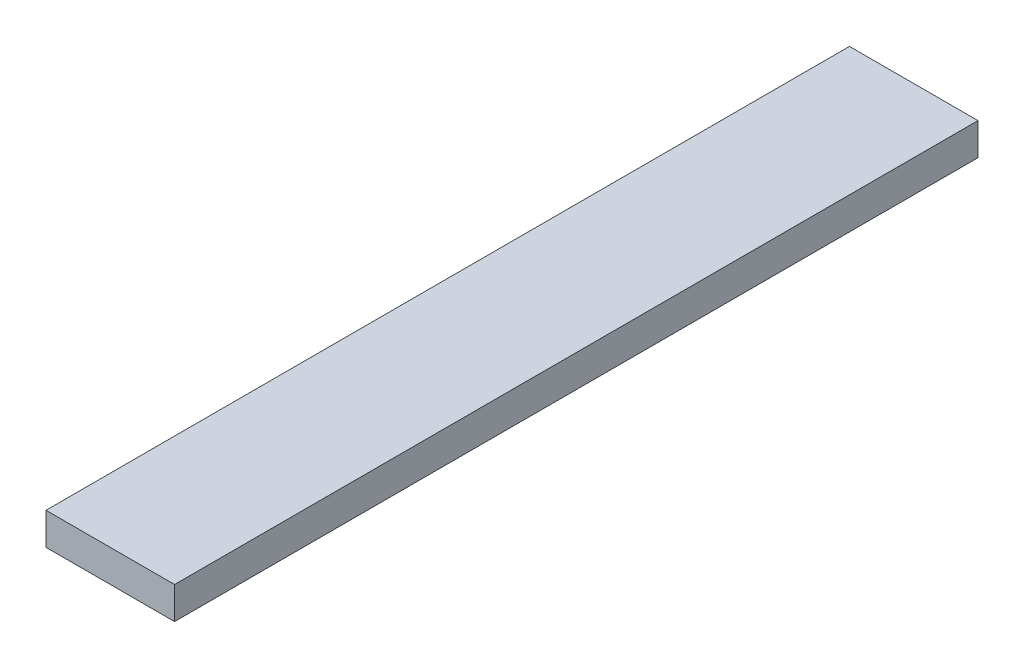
ISO-10303-21;
HEADER;
FILE_DESCRIPTION(('STEP AP214'),'2;1');
FILE_NAME('part.step','',(''),(''),'','','');
FILE_SCHEMA(('AUTOMOTIVE_DESIGN { 1 0 10303 214 1 1 1 1 }'));
ENDSEC;
DATA;
#1=APPLICATION_CONTEXT('core data for automotive mechanical design processes');
#2=APPLICATION_PROTOCOL_DEFINITION('international standard','automotive_design',2000,#1);
#3=PRODUCT_CONTEXT('',#1,'mechanical');
#4=PRODUCT('Part','Part','',(#3));
#5=PRODUCT_RELATED_PRODUCT_CATEGORY('part','',(#4));
#6=PRODUCT_DEFINITION_FORMATION('','',#4);
#7=PRODUCT_DEFINITION_CONTEXT('part definition',#1,'design');
#8=PRODUCT_DEFINITION('design','',#6,#7);
#9=PRODUCT_DEFINITION_SHAPE('','',#8);
#10=(LENGTH_UNIT() NAMED_UNIT(*) SI_UNIT(.MILLI.,.METRE.));
#11=(NAMED_UNIT(*) PLANE_ANGLE_UNIT() SI_UNIT($,.RADIAN.));
#12=(NAMED_UNIT(*) SI_UNIT($,.STERADIAN.) SOLID_ANGLE_UNIT());
#13=UNCERTAINTY_MEASURE_WITH_UNIT(LENGTH_MEASURE(1.E-05),#10,'distance_accuracy_value','');
#14=(GEOMETRIC_REPRESENTATION_CONTEXT(3) GLOBAL_UNCERTAINTY_ASSIGNED_CONTEXT((#13)) GLOBAL_UNIT_ASSIGNED_CONTEXT((#10,
#11,#12)) REPRESENTATION_CONTEXT('',''));
#15=CARTESIAN_POINT('',(0.,0.,0.));
#16=DIRECTION('',(0.,0.,1.));
#17=DIRECTION('',(1.,0.,0.));
#18=AXIS2_PLACEMENT_3D('',#15,#16,#17);
#19=CARTESIAN_POINT('',(0.,0.,50.));
#20=DIRECTION('',(1.,0.,0.));
#21=DIRECTION('',(0.,0.,-1.));
#22=AXIS2_PLACEMENT_3D('',#19,#20,#21);
#23=PLANE('',#22);
#24=DIRECTION('',(0.,-1.,0.));
#25=VECTOR('',#24,1.);
#26=CARTESIAN_POINT('',(0.,0.,0.));
#27=LINE('',#26,#25);
#28=CARTESIAN_POINT('',(0.,2.,0.));
#29=VERTEX_POINT('',#28);
#30=CARTESIAN_POINT('',(0.,0.,0.));
#31=VERTEX_POINT('',#30);
#32=EDGE_CURVE('E70',#29,#31,#27,.T.);
#33=ORIENTED_EDGE('',*,*,#32,.T.);
#34=DIRECTION('',(0.,0.,-1.));
#35=VECTOR('',#34,1.);
#36=CARTESIAN_POINT('',(0.,0.,50.));
#37=LINE('',#36,#35);
#38=CARTESIAN_POINT('',(0.,0.,50.));
#39=VERTEX_POINT('',#38);
#40=EDGE_CURVE('E11',#39,#31,#37,.T.);
#41=ORIENTED_EDGE('',*,*,#40,.F.);
#42=DIRECTION('',(0.,-1.,0.));
#43=VECTOR('',#42,1.);
#44=CARTESIAN_POINT('',(0.,0.,50.));
#45=LINE('',#44,#43);
#46=CARTESIAN_POINT('',(0.,2.,50.));
#47=VERTEX_POINT('',#46);
#48=EDGE_CURVE('E88',#47,#39,#45,.T.);
#49=ORIENTED_EDGE('',*,*,#48,.F.);
#50=DIRECTION('',(0.,0.,-1.));
#51=VECTOR('',#50,1.);
#52=CARTESIAN_POINT('',(0.,2.,50.));
#53=LINE('',#52,#51);
#54=EDGE_CURVE('E82',#47,#29,#53,.T.);
#55=ORIENTED_EDGE('',*,*,#54,.T.);
#56=EDGE_LOOP('',(#33,#41,#49,#55));
#57=FACE_BOUND('',#56,.T.);
#58=ADVANCED_FACE('F26',(#57),#23,.F.);
#59=CARTESIAN_POINT('',(0.,0.,50.));
#60=DIRECTION('',(0.,1.,0.));
#61=DIRECTION('',(0.,0.,1.));
#62=AXIS2_PLACEMENT_3D('',#59,#60,#61);
#63=PLANE('',#62);
#64=DIRECTION('',(1.,0.,0.));
#65=VECTOR('',#64,1.);
#66=CARTESIAN_POINT('',(0.,0.,0.));
#67=LINE('',#66,#65);
#68=CARTESIAN_POINT('',(8.,0.,0.));
#69=VERTEX_POINT('',#68);
#70=EDGE_CURVE('E66',#31,#69,#67,.T.);
#71=ORIENTED_EDGE('',*,*,#70,.T.);
#72=DIRECTION('',(0.,0.,-1.));
#73=VECTOR('',#72,1.);
#74=CARTESIAN_POINT('',(8.,0.,50.));
#75=LINE('',#74,#73);
#76=CARTESIAN_POINT('',(8.,0.,50.));
#77=VERTEX_POINT('',#76);
#78=EDGE_CURVE('E33',#77,#69,#75,.T.);
#79=ORIENTED_EDGE('',*,*,#78,.F.);
#80=DIRECTION('',(1.,0.,0.));
#81=VECTOR('',#80,1.);
#82=CARTESIAN_POINT('',(0.,0.,50.));
#83=LINE('',#82,#81);
#84=EDGE_CURVE('E78',#39,#77,#83,.T.);
#85=ORIENTED_EDGE('',*,*,#84,.F.);
#86=ORIENTED_EDGE('',*,*,#40,.T.);
#87=EDGE_LOOP('',(#71,#79,#85,#86));
#88=FACE_BOUND('',#87,.T.);
#89=ADVANCED_FACE('F77',(#88),#63,.F.);
#90=CARTESIAN_POINT('',(8.,0.,50.));
#91=DIRECTION('',(-1.,0.,0.));
#92=DIRECTION('',(0.,0.,1.));
#93=AXIS2_PLACEMENT_3D('',#90,#91,#92);
#94=PLANE('',#93);
#95=DIRECTION('',(0.,1.,0.));
#96=VECTOR('',#95,1.);
#97=CARTESIAN_POINT('',(8.,0.,0.));
#98=LINE('',#97,#96);
#99=CARTESIAN_POINT('',(8.,2.,0.));
#100=VERTEX_POINT('',#99);
#101=EDGE_CURVE('E71',#69,#100,#98,.T.);
#102=ORIENTED_EDGE('',*,*,#101,.T.);
#103=DIRECTION('',(0.,0.,-1.));
#104=VECTOR('',#103,1.);
#105=CARTESIAN_POINT('',(8.,2.,50.));
#106=LINE('',#105,#104);
#107=CARTESIAN_POINT('',(8.,2.,50.));
#108=VERTEX_POINT('',#107);
#109=EDGE_CURVE('E94',#108,#100,#106,.T.);
#110=ORIENTED_EDGE('',*,*,#109,.F.);
#111=DIRECTION('',(0.,1.,0.));
#112=VECTOR('',#111,1.);
#113=CARTESIAN_POINT('',(8.,0.,50.));
#114=LINE('',#113,#112);
#115=EDGE_CURVE('E45',#77,#108,#114,.T.);
#116=ORIENTED_EDGE('',*,*,#115,.F.);
#117=ORIENTED_EDGE('',*,*,#78,.T.);
#118=EDGE_LOOP('',(#102,#110,#116,#117));
#119=FACE_BOUND('',#118,.T.);
#120=ADVANCED_FACE('F97',(#119),#94,.F.);
#121=CARTESIAN_POINT('',(0.,2.,50.));
#122=DIRECTION('',(0.,-1.,0.));
#123=DIRECTION('',(0.,0.,-1.));
#124=AXIS2_PLACEMENT_3D('',#121,#122,#123);
#125=PLANE('',#124);
#126=DIRECTION('',(-1.,0.,0.));
#127=VECTOR('',#126,1.);
#128=CARTESIAN_POINT('',(0.,2.,0.));
#129=LINE('',#128,#127);
#130=EDGE_CURVE('E86',#100,#29,#129,.T.);
#131=ORIENTED_EDGE('',*,*,#130,.T.);
#132=ORIENTED_EDGE('',*,*,#54,.F.);
#133=DIRECTION('',(-1.,0.,0.));
#134=VECTOR('',#133,1.);
#135=CARTESIAN_POINT('',(0.,2.,50.));
#136=LINE('',#135,#134);
#137=EDGE_CURVE('E40',#108,#47,#136,.T.);
#138=ORIENTED_EDGE('',*,*,#137,.F.);
#139=ORIENTED_EDGE('',*,*,#109,.T.);
#140=EDGE_LOOP('',(#131,#132,#138,#139));
#141=FACE_BOUND('',#140,.T.);
#142=ADVANCED_FACE('F99',(#141),#125,.F.);
#143=CARTESIAN_POINT('',(0.,2.,50.));
#144=DIRECTION('',(0.,0.,-1.));
#145=DIRECTION('',(-1.,0.,0.));
#146=AXIS2_PLACEMENT_3D('',#143,#144,#145);
#147=PLANE('',#146);
#148=ORIENTED_EDGE('',*,*,#48,.T.);
#149=ORIENTED_EDGE('',*,*,#84,.T.);
#150=ORIENTED_EDGE('',*,*,#115,.T.);
#151=ORIENTED_EDGE('',*,*,#137,.T.);
#152=EDGE_LOOP('',(#148,#149,#150,#151));
#153=FACE_BOUND('',#152,.T.);
#154=ADVANCED_FACE('F100',(#153),#147,.F.);
#155=CARTESIAN_POINT('',(0.,2.,0.));
#156=DIRECTION('',(0.,0.,-1.));
#157=DIRECTION('',(-1.,0.,0.));
#158=AXIS2_PLACEMENT_3D('',#155,#156,#157);
#159=PLANE('',#158);
#160=ORIENTED_EDGE('',*,*,#32,.F.);
#161=ORIENTED_EDGE('',*,*,#130,.F.);
#162=ORIENTED_EDGE('',*,*,#101,.F.);
#163=ORIENTED_EDGE('',*,*,#70,.F.);
#164=EDGE_LOOP('',(#160,#161,#162,#163));
#165=FACE_BOUND('',#164,.T.);
#166=ADVANCED_FACE('F67',(#165),#159,.T.);
#167=CLOSED_SHELL('',(#58,#89,#120,#142,#154,#166));
#168=MANIFOLD_SOLID_BREP('B2',#167);
#169=ADVANCED_BREP_SHAPE_REPRESENTATION('',(#18,#168),#14);
#170=SHAPE_DEFINITION_REPRESENTATION(#9,#169);
ENDSEC;
END-ISO-10303-21;
